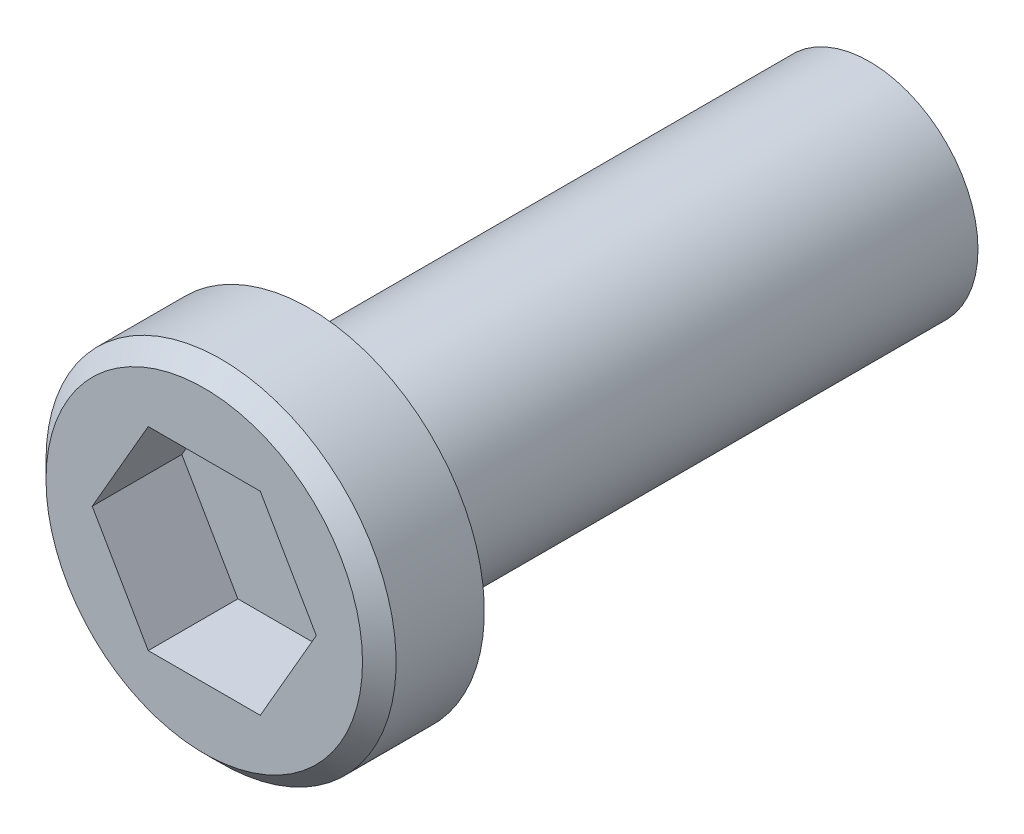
ISO-10303-21;
HEADER;
FILE_DESCRIPTION(('STEP AP214'),'2;1');
FILE_NAME('part.step','',(''),(''),'','','');
FILE_SCHEMA(('AUTOMOTIVE_DESIGN { 1 0 10303 214 1 1 1 1 }'));
ENDSEC;
DATA;
#1=APPLICATION_CONTEXT('core data for automotive mechanical design processes');
#2=APPLICATION_PROTOCOL_DEFINITION('international standard','automotive_design',2000,#1);
#3=PRODUCT_CONTEXT('',#1,'mechanical');
#4=PRODUCT('Part','Part','',(#3));
#5=PRODUCT_RELATED_PRODUCT_CATEGORY('part','',(#4));
#6=PRODUCT_DEFINITION_FORMATION('','',#4);
#7=PRODUCT_DEFINITION_CONTEXT('part definition',#1,'design');
#8=PRODUCT_DEFINITION('design','',#6,#7);
#9=PRODUCT_DEFINITION_SHAPE('','',#8);
#10=(LENGTH_UNIT() NAMED_UNIT(*) SI_UNIT(.MILLI.,.METRE.));
#11=(NAMED_UNIT(*) PLANE_ANGLE_UNIT() SI_UNIT($,.RADIAN.));
#12=(NAMED_UNIT(*) SI_UNIT($,.STERADIAN.) SOLID_ANGLE_UNIT());
#13=UNCERTAINTY_MEASURE_WITH_UNIT(LENGTH_MEASURE(1.E-05),#10,'distance_accuracy_value','');
#14=(GEOMETRIC_REPRESENTATION_CONTEXT(3) GLOBAL_UNCERTAINTY_ASSIGNED_CONTEXT((#13)) GLOBAL_UNIT_ASSIGNED_CONTEXT((#10,
#11,#12)) REPRESENTATION_CONTEXT('',''));
#15=CARTESIAN_POINT('',(0.,0.,0.));
#16=DIRECTION('',(0.,0.,1.));
#17=DIRECTION('',(1.,0.,0.));
#18=AXIS2_PLACEMENT_3D('',#15,#16,#17);
#19=CARTESIAN_POINT('',(0.,0.,25.4));
#20=DIRECTION('',(0.,0.,-1.));
#21=DIRECTION('',(-1.,0.,0.));
#22=AXIS2_PLACEMENT_3D('',#19,#20,#21);
#23=CYLINDRICAL_SURFACE('',#22,4.92125);
#24=CARTESIAN_POINT('',(0.,0.,25.4));
#25=DIRECTION('',(0.,0.,1.));
#26=DIRECTION('',(1.,0.,0.));
#27=AXIS2_PLACEMENT_3D('',#24,#25,#26);
#28=CIRCLE('',#27,4.92125);
#29=CARTESIAN_POINT('',(4.92125,0.,25.4));
#30=VERTEX_POINT('',#29);
#31=EDGE_CURVE('E143',#30,#30,#28,.T.);
#32=ORIENTED_EDGE('',*,*,#31,.F.);
#33=EDGE_LOOP('',(#32));
#34=FACE_BOUND('',#33,.T.);
#35=CARTESIAN_POINT('',(0.,0.,0.));
#36=DIRECTION('',(0.,0.,1.));
#37=DIRECTION('',(1.,0.,0.));
#38=AXIS2_PLACEMENT_3D('',#35,#36,#37);
#39=CIRCLE('',#38,4.92125);
#40=CARTESIAN_POINT('',(4.92125,0.,0.));
#41=VERTEX_POINT('',#40);
#42=EDGE_CURVE('E140',#41,#41,#39,.T.);
#43=ORIENTED_EDGE('',*,*,#42,.T.);
#44=EDGE_LOOP('',(#43));
#45=FACE_BOUND('',#44,.T.);
#46=ADVANCED_FACE('F29',(#34,#45),#23,.T.);
#47=CARTESIAN_POINT('',(0.,0.,0.));
#48=DIRECTION('',(0.,0.,1.));
#49=DIRECTION('',(1.,0.,0.));
#50=AXIS2_PLACEMENT_3D('',#47,#48,#49);
#51=PLANE('',#50);
#52=ORIENTED_EDGE('',*,*,#42,.F.);
#53=EDGE_LOOP('',(#52));
#54=FACE_BOUND('',#53,.T.);
#55=ADVANCED_FACE('F164',(#54),#51,.F.);
#56=CARTESIAN_POINT('',(0.,0.,25.4));
#57=DIRECTION('',(0.,0.,1.));
#58=DIRECTION('',(1.,0.,0.));
#59=AXIS2_PLACEMENT_3D('',#56,#57,#58);
#60=PLANE('',#59);
#61=CARTESIAN_POINT('',(0.,0.,25.4));
#62=DIRECTION('',(0.,0.,1.));
#63=DIRECTION('',(1.,0.,0.));
#64=AXIS2_PLACEMENT_3D('',#61,#62,#63);
#65=CIRCLE('',#64,7.9375);
#66=CARTESIAN_POINT('',(-7.9375,0.,25.4));
#67=VERTEX_POINT('',#66);
#68=EDGE_CURVE('E131',#67,#67,#65,.T.);
#69=ORIENTED_EDGE('',*,*,#68,.F.);
#70=EDGE_LOOP('',(#69));
#71=FACE_BOUND('',#70,.T.);
#72=ORIENTED_EDGE('',*,*,#31,.T.);
#73=EDGE_LOOP('',(#72));
#74=FACE_BOUND('',#73,.T.);
#75=ADVANCED_FACE('F169',(#71,#74),#60,.F.);
#76=CARTESIAN_POINT('',(0.,0.,30.1625));
#77=DIRECTION('',(0.,0.,-1.));
#78=DIRECTION('',(-1.,0.,0.));
#79=AXIS2_PLACEMENT_3D('',#76,#77,#78);
#80=CYLINDRICAL_SURFACE('',#79,7.9375);
#81=CARTESIAN_POINT('',(0.,0.,29.4005));
#82=DIRECTION('',(0.,0.,1.));
#83=DIRECTION('',(1.,0.,0.));
#84=AXIS2_PLACEMENT_3D('',#81,#82,#83);
#85=CIRCLE('',#84,7.9375);
#86=CARTESIAN_POINT('',(-7.9375,0.,29.4005));
#87=VERTEX_POINT('',#86);
#88=EDGE_CURVE('E11',#87,#87,#85,.F.);
#89=CARTESIAN_POINT('',(-7.9375,0.,29.4005));
#90=CARTESIAN_POINT('',(-7.9375,0.,29.358828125));
#91=CARTESIAN_POINT('',(-7.9375,0.,29.31715625));
#92=CARTESIAN_POINT('',(-7.9375,0.,29.2338125));
#93=CARTESIAN_POINT('',(-7.9375,0.,29.192140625));
#94=CARTESIAN_POINT('',(-7.9375,0.,29.108796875));
#95=CARTESIAN_POINT('',(-7.9375,0.,29.067125));
#96=CARTESIAN_POINT('',(-7.9375,0.,28.98378125));
#97=CARTESIAN_POINT('',(-7.9375,0.,28.942109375));
#98=CARTESIAN_POINT('',(-7.9375,0.,28.858765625));
#99=CARTESIAN_POINT('',(-7.9375,0.,28.81709375));
#100=CARTESIAN_POINT('',(-7.9375,0.,28.73375));
#101=CARTESIAN_POINT('',(-7.9375,0.,28.692078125));
#102=CARTESIAN_POINT('',(-7.9375,0.,28.608734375));
#103=CARTESIAN_POINT('',(-7.9375,0.,28.5670625));
#104=CARTESIAN_POINT('',(-7.9375,0.,28.48371875));
#105=CARTESIAN_POINT('',(-7.9375,0.,28.442046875));
#106=CARTESIAN_POINT('',(-7.9375,0.,28.358703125));
#107=CARTESIAN_POINT('',(-7.9375,0.,28.31703125));
#108=CARTESIAN_POINT('',(-7.9375,0.,28.2336875));
#109=CARTESIAN_POINT('',(-7.9375,0.,28.192015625));
#110=CARTESIAN_POINT('',(-7.9375,0.,28.108671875));
#111=CARTESIAN_POINT('',(-7.9375,0.,28.067));
#112=CARTESIAN_POINT('',(-7.9375,0.,27.98365625));
#113=CARTESIAN_POINT('',(-7.9375,0.,27.941984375));
#114=CARTESIAN_POINT('',(-7.9375,0.,27.858640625));
#115=CARTESIAN_POINT('',(-7.9375,0.,27.81696875));
#116=CARTESIAN_POINT('',(-7.9375,0.,27.733625));
#117=CARTESIAN_POINT('',(-7.9375,0.,27.691953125));
#118=CARTESIAN_POINT('',(-7.9375,0.,27.608609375));
#119=CARTESIAN_POINT('',(-7.9375,0.,27.5669375));
#120=CARTESIAN_POINT('',(-7.9375,0.,27.48359375));
#121=CARTESIAN_POINT('',(-7.9375,0.,27.441921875));
#122=CARTESIAN_POINT('',(-7.9375,0.,27.358578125));
#123=CARTESIAN_POINT('',(-7.9375,0.,27.31690625));
#124=CARTESIAN_POINT('',(-7.9375,0.,27.2335625));
#125=CARTESIAN_POINT('',(-7.9375,0.,27.191890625));
#126=CARTESIAN_POINT('',(-7.9375,0.,27.108546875));
#127=CARTESIAN_POINT('',(-7.9375,0.,27.066875));
#128=CARTESIAN_POINT('',(-7.9375,0.,26.98353125));
#129=CARTESIAN_POINT('',(-7.9375,0.,26.941859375));
#130=CARTESIAN_POINT('',(-7.9375,0.,26.858515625));
#131=CARTESIAN_POINT('',(-7.9375,0.,26.81684375));
#132=CARTESIAN_POINT('',(-7.9375,0.,26.7335));
#133=CARTESIAN_POINT('',(-7.9375,0.,26.691828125));
#134=CARTESIAN_POINT('',(-7.9375,0.,26.608484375));
#135=CARTESIAN_POINT('',(-7.9375,0.,26.5668125));
#136=CARTESIAN_POINT('',(-7.9375,0.,26.48346875));
#137=CARTESIAN_POINT('',(-7.9375,0.,26.441796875));
#138=CARTESIAN_POINT('',(-7.9375,0.,26.358453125));
#139=CARTESIAN_POINT('',(-7.9375,0.,26.31678125));
#140=CARTESIAN_POINT('',(-7.9375,0.,26.2334375));
#141=CARTESIAN_POINT('',(-7.9375,0.,26.191765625));
#142=CARTESIAN_POINT('',(-7.9375,0.,26.108421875));
#143=CARTESIAN_POINT('',(-7.9375,0.,26.06675));
#144=CARTESIAN_POINT('',(-7.9375,0.,25.98340625));
#145=CARTESIAN_POINT('',(-7.9375,0.,25.941734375));
#146=CARTESIAN_POINT('',(-7.9375,0.,25.858390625));
#147=CARTESIAN_POINT('',(-7.9375,0.,25.81671875));
#148=CARTESIAN_POINT('',(-7.9375,0.,25.733375));
#149=CARTESIAN_POINT('',(-7.9375,0.,25.691703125));
#150=CARTESIAN_POINT('',(-7.9375,0.,25.608359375));
#151=CARTESIAN_POINT('',(-7.9375,0.,25.5666875));
#152=CARTESIAN_POINT('',(-7.9375,0.,25.48334375));
#153=CARTESIAN_POINT('',(-7.9375,0.,25.441671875));
#154=CARTESIAN_POINT('',(-7.9375,0.,25.4));
#155=B_SPLINE_CURVE_WITH_KNOTS('',3,(#89,#90,#91,#92,#93,#94,#95,#96,#97,#98,#99,#100,#101,#102,
#103,#104,#105,#106,#107,#108,#109,#110,#111,#112,#113,#114,#115,#116,#117,#118,#119,#120,#121,
#122,#123,#124,#125,#126,#127,#128,#129,#130,#131,#132,#133,#134,#135,#136,#137,#138,#139,#140,
#141,#142,#143,#144,#145,#146,#147,#148,#149,#150,#151,#152,#153,#154),.UNSPECIFIED.,.F.,.F.,(4,
2,2,2,2,2,2,2,2,2,2,2,2,2,2,2,2,2,2,2,2,2,2,2,2,2,2,2,2,2,2,2,4),(0.,0.125015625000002,
0.250031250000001,0.375046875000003,0.500062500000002,0.625078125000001,0.750093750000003,
0.875109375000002,1.000125,1.125140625,1.25015625,1.375171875,1.5001875,1.625203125,1.75021875,
1.875234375,2.00025,2.125265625,2.25028125,2.375296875,2.5003125,2.625328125,2.75034375,
2.875359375,3.000375,3.125390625,3.25040625,3.375421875,3.5004375,3.625453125,3.75046875,
3.875484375,4.0005),.UNSPECIFIED.);
#156=EDGE_CURVE('BSEAM159',#87,#67,#155,.T.);
#157=ORIENTED_EDGE('',*,*,#88,.T.);
#158=ORIENTED_EDGE('',*,*,#68,.T.);
#159=ORIENTED_EDGE('',*,*,#156,.T.);
#160=ORIENTED_EDGE('',*,*,#156,.F.);
#161=EDGE_LOOP('',(#157,#159,#158,#160));
#162=FACE_BOUND('',#161,.T.);
#163=ADVANCED_FACE('F159',(#162),#80,.T.);
#164=CARTESIAN_POINT('',(0.,0.,30.1625));
#165=DIRECTION('',(0.,0.,1.));
#166=DIRECTION('',(1.,0.,0.));
#167=AXIS2_PLACEMENT_3D('',#164,#165,#166);
#168=PLANE('',#167);
#169=DIRECTION('',(0.5,0.866025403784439,0.));
#170=VECTOR('',#169,1.);
#171=CARTESIAN_POINT('',(2.54,-4.39940905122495,30.1625));
#172=LINE('',#171,#170);
#173=CARTESIAN_POINT('',(2.54,-4.39940905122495,30.1625));
#174=VERTEX_POINT('',#173);
#175=CARTESIAN_POINT('',(5.08,0.,30.1625));
#176=VERTEX_POINT('',#175);
#177=EDGE_CURVE('E43',#174,#176,#172,.T.);
#178=ORIENTED_EDGE('',*,*,#177,.F.);
#179=DIRECTION('',(1.,0.,0.));
#180=VECTOR('',#179,1.);
#181=CARTESIAN_POINT('',(-2.54,-4.39940905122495,30.1625));
#182=LINE('',#181,#180);
#183=CARTESIAN_POINT('',(-2.54,-4.39940905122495,30.1625));
#184=VERTEX_POINT('',#183);
#185=EDGE_CURVE('E113',#184,#174,#182,.T.);
#186=ORIENTED_EDGE('',*,*,#185,.F.);
#187=DIRECTION('',(0.5,-0.866025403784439,0.));
#188=VECTOR('',#187,1.);
#189=CARTESIAN_POINT('',(-5.08,0.,30.1625));
#190=LINE('',#189,#188);
#191=CARTESIAN_POINT('',(-5.08,0.,30.1625));
#192=VERTEX_POINT('',#191);
#193=EDGE_CURVE('E107',#192,#184,#190,.T.);
#194=ORIENTED_EDGE('',*,*,#193,.F.);
#195=DIRECTION('',(-0.5,-0.866025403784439,0.));
#196=VECTOR('',#195,1.);
#197=CARTESIAN_POINT('',(-2.54,4.39940905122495,30.1625));
#198=LINE('',#197,#196);
#199=CARTESIAN_POINT('',(-2.54,4.39940905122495,30.1625));
#200=VERTEX_POINT('',#199);
#201=EDGE_CURVE('E105',#200,#192,#198,.T.);
#202=ORIENTED_EDGE('',*,*,#201,.F.);
#203=DIRECTION('',(-1.,0.,0.));
#204=VECTOR('',#203,1.);
#205=CARTESIAN_POINT('',(2.54,4.39940905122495,30.1625));
#206=LINE('',#205,#204);
#207=CARTESIAN_POINT('',(2.54,4.39940905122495,30.1625));
#208=VERTEX_POINT('',#207);
#209=EDGE_CURVE('E86',#208,#200,#206,.T.);
#210=ORIENTED_EDGE('',*,*,#209,.F.);
#211=DIRECTION('',(-0.5,0.866025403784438,0.));
#212=VECTOR('',#211,1.);
#213=CARTESIAN_POINT('',(5.08,0.,30.1625));
#214=LINE('',#213,#212);
#215=EDGE_CURVE('E97',#176,#208,#214,.T.);
#216=ORIENTED_EDGE('',*,*,#215,.F.);
#217=EDGE_LOOP('',(#178,#186,#194,#202,#210,#216));
#218=FACE_BOUND('',#217,.T.);
#219=CARTESIAN_POINT('',(0.,0.,30.1625));
#220=DIRECTION('',(0.,0.,1.));
#221=DIRECTION('',(1.,0.,0.));
#222=AXIS2_PLACEMENT_3D('',#219,#220,#221);
#223=CIRCLE('',#222,7.1755);
#224=CARTESIAN_POINT('',(7.1755,0.,30.1625));
#225=VERTEX_POINT('',#224);
#226=EDGE_CURVE('E36',#225,#225,#223,.T.);
#227=ORIENTED_EDGE('',*,*,#226,.T.);
#228=EDGE_LOOP('',(#227));
#229=FACE_BOUND('',#228,.T.);
#230=ADVANCED_FACE('F101',(#218,#229),#168,.T.);
#231=CARTESIAN_POINT('',(0.,0.,30.1625));
#232=DIRECTION('',(0.,0.,-1.));
#233=DIRECTION('',(-1.,0.,0.));
#234=AXIS2_PLACEMENT_3D('',#231,#232,#233);
#235=CONICAL_SURFACE('',#234,7.1755,0.785398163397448);
#236=ORIENTED_EDGE('',*,*,#88,.F.);
#237=EDGE_LOOP('',(#236));
#238=FACE_BOUND('',#237,.T.);
#239=ORIENTED_EDGE('',*,*,#226,.F.);
#240=EDGE_LOOP('',(#239));
#241=FACE_BOUND('',#240,.T.);
#242=ADVANCED_FACE('F148',(#238,#241),#235,.T.);
#243=CARTESIAN_POINT('',(2.54,-4.39940905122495,26.0985));
#244=DIRECTION('',(0.866025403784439,-0.5,0.));
#245=DIRECTION('',(0.5,0.866025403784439,0.));
#246=AXIS2_PLACEMENT_3D('',#243,#244,#245);
#247=PLANE('',#246);
#248=ORIENTED_EDGE('',*,*,#177,.T.);
#249=DIRECTION('',(0.,0.,1.));
#250=VECTOR('',#249,1.);
#251=CARTESIAN_POINT('',(5.08,0.,26.0985));
#252=LINE('',#251,#250);
#253=CARTESIAN_POINT('',(5.08,0.,26.0985));
#254=VERTEX_POINT('',#253);
#255=EDGE_CURVE('E94',#254,#176,#252,.T.);
#256=ORIENTED_EDGE('',*,*,#255,.F.);
#257=DIRECTION('',(0.5,0.866025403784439,0.));
#258=VECTOR('',#257,1.);
#259=CARTESIAN_POINT('',(2.54,-4.39940905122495,26.0985));
#260=LINE('',#259,#258);
#261=CARTESIAN_POINT('',(2.54,-4.39940905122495,26.0985));
#262=VERTEX_POINT('',#261);
#263=EDGE_CURVE('E115',#262,#254,#260,.T.);
#264=ORIENTED_EDGE('',*,*,#263,.F.);
#265=DIRECTION('',(0.,0.,1.));
#266=VECTOR('',#265,1.);
#267=CARTESIAN_POINT('',(2.54,-4.39940905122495,26.0985));
#268=LINE('',#267,#266);
#269=EDGE_CURVE('E50',#262,#174,#268,.T.);
#270=ORIENTED_EDGE('',*,*,#269,.T.);
#271=EDGE_LOOP('',(#248,#256,#264,#270));
#272=FACE_BOUND('',#271,.T.);
#273=ADVANCED_FACE('F150',(#272),#247,.F.);
#274=CARTESIAN_POINT('',(-2.54,-4.39940905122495,26.0985));
#275=DIRECTION('',(0.,-1.,0.));
#276=DIRECTION('',(0.,0.,-1.));
#277=AXIS2_PLACEMENT_3D('',#274,#275,#276);
#278=PLANE('',#277);
#279=ORIENTED_EDGE('',*,*,#185,.T.);
#280=ORIENTED_EDGE('',*,*,#269,.F.);
#281=DIRECTION('',(1.,0.,0.));
#282=VECTOR('',#281,1.);
#283=CARTESIAN_POINT('',(-2.54,-4.39940905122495,26.0985));
#284=LINE('',#283,#282);
#285=CARTESIAN_POINT('',(-2.54,-4.39940905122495,26.0985));
#286=VERTEX_POINT('',#285);
#287=EDGE_CURVE('E127',#286,#262,#284,.T.);
#288=ORIENTED_EDGE('',*,*,#287,.F.);
#289=DIRECTION('',(0.,0.,1.));
#290=VECTOR('',#289,1.);
#291=CARTESIAN_POINT('',(-2.54,-4.39940905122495,26.0985));
#292=LINE('',#291,#290);
#293=EDGE_CURVE('E132',#286,#184,#292,.T.);
#294=ORIENTED_EDGE('',*,*,#293,.T.);
#295=EDGE_LOOP('',(#279,#280,#288,#294));
#296=FACE_BOUND('',#295,.T.);
#297=ADVANCED_FACE('F157',(#296),#278,.F.);
#298=CARTESIAN_POINT('',(-5.08,0.,26.0985));
#299=DIRECTION('',(-0.866025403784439,-0.5,0.));
#300=DIRECTION('',(0.5,-0.866025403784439,0.));
#301=AXIS2_PLACEMENT_3D('',#298,#299,#300);
#302=PLANE('',#301);
#303=ORIENTED_EDGE('',*,*,#193,.T.);
#304=ORIENTED_EDGE('',*,*,#293,.F.);
#305=DIRECTION('',(0.5,-0.866025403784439,0.));
#306=VECTOR('',#305,1.);
#307=CARTESIAN_POINT('',(-5.08,0.,26.0985));
#308=LINE('',#307,#306);
#309=CARTESIAN_POINT('',(-5.08,0.,26.0985));
#310=VERTEX_POINT('',#309);
#311=EDGE_CURVE('E124',#310,#286,#308,.T.);
#312=ORIENTED_EDGE('',*,*,#311,.F.);
#313=DIRECTION('',(0.,0.,1.));
#314=VECTOR('',#313,1.);
#315=CARTESIAN_POINT('',(-5.08,0.,26.0985));
#316=LINE('',#315,#314);
#317=EDGE_CURVE('E134',#310,#192,#316,.T.);
#318=ORIENTED_EDGE('',*,*,#317,.T.);
#319=EDGE_LOOP('',(#303,#304,#312,#318));
#320=FACE_BOUND('',#319,.T.);
#321=ADVANCED_FACE('F207',(#320),#302,.F.);
#322=CARTESIAN_POINT('',(-2.54,4.39940905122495,26.0985));
#323=DIRECTION('',(-0.866025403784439,0.5,0.));
#324=DIRECTION('',(-0.5,-0.866025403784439,0.));
#325=AXIS2_PLACEMENT_3D('',#322,#323,#324);
#326=PLANE('',#325);
#327=ORIENTED_EDGE('',*,*,#201,.T.);
#328=ORIENTED_EDGE('',*,*,#317,.F.);
#329=DIRECTION('',(-0.5,-0.866025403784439,0.));
#330=VECTOR('',#329,1.);
#331=CARTESIAN_POINT('',(-2.54,4.39940905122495,26.0985));
#332=LINE('',#331,#330);
#333=CARTESIAN_POINT('',(-2.54,4.39940905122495,26.0985));
#334=VERTEX_POINT('',#333);
#335=EDGE_CURVE('E121',#334,#310,#332,.T.);
#336=ORIENTED_EDGE('',*,*,#335,.F.);
#337=DIRECTION('',(0.,0.,1.));
#338=VECTOR('',#337,1.);
#339=CARTESIAN_POINT('',(-2.54,4.39940905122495,26.0985));
#340=LINE('',#339,#338);
#341=EDGE_CURVE('E93',#334,#200,#340,.T.);
#342=ORIENTED_EDGE('',*,*,#341,.T.);
#343=EDGE_LOOP('',(#327,#328,#336,#342));
#344=FACE_BOUND('',#343,.T.);
#345=ADVANCED_FACE('F216',(#344),#326,.F.);
#346=CARTESIAN_POINT('',(2.54,4.39940905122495,26.0985));
#347=DIRECTION('',(0.,1.,0.));
#348=DIRECTION('',(-1.,0.,0.));
#349=AXIS2_PLACEMENT_3D('',#346,#347,#348);
#350=PLANE('',#349);
#351=ORIENTED_EDGE('',*,*,#209,.T.);
#352=ORIENTED_EDGE('',*,*,#341,.F.);
#353=DIRECTION('',(-1.,0.,0.));
#354=VECTOR('',#353,1.);
#355=CARTESIAN_POINT('',(2.54,4.39940905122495,26.0985));
#356=LINE('',#355,#354);
#357=CARTESIAN_POINT('',(2.54,4.39940905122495,26.0985));
#358=VERTEX_POINT('',#357);
#359=EDGE_CURVE('E89',#358,#334,#356,.T.);
#360=ORIENTED_EDGE('',*,*,#359,.F.);
#361=DIRECTION('',(0.,0.,1.));
#362=VECTOR('',#361,1.);
#363=CARTESIAN_POINT('',(2.54,4.39940905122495,26.0985));
#364=LINE('',#363,#362);
#365=EDGE_CURVE('E82',#358,#208,#364,.T.);
#366=ORIENTED_EDGE('',*,*,#365,.T.);
#367=EDGE_LOOP('',(#351,#352,#360,#366));
#368=FACE_BOUND('',#367,.T.);
#369=ADVANCED_FACE('F84',(#368),#350,.F.);
#370=CARTESIAN_POINT('',(5.08,0.,26.0985));
#371=DIRECTION('',(0.866025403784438,0.5,0.));
#372=DIRECTION('',(-0.5,0.866025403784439,0.));
#373=AXIS2_PLACEMENT_3D('',#370,#371,#372);
#374=PLANE('',#373);
#375=ORIENTED_EDGE('',*,*,#215,.T.);
#376=ORIENTED_EDGE('',*,*,#365,.F.);
#377=DIRECTION('',(-0.5,0.866025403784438,0.));
#378=VECTOR('',#377,1.);
#379=CARTESIAN_POINT('',(5.08,0.,26.0985));
#380=LINE('',#379,#378);
#381=EDGE_CURVE('E118',#254,#358,#380,.T.);
#382=ORIENTED_EDGE('',*,*,#381,.F.);
#383=ORIENTED_EDGE('',*,*,#255,.T.);
#384=EDGE_LOOP('',(#375,#376,#382,#383));
#385=FACE_BOUND('',#384,.T.);
#386=ADVANCED_FACE('F98',(#385),#374,.F.);
#387=CARTESIAN_POINT('',(7.62,4.39940905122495,26.0985));
#388=DIRECTION('',(0.,0.,1.));
#389=DIRECTION('',(1.,0.,0.));
#390=AXIS2_PLACEMENT_3D('',#387,#388,#389);
#391=PLANE('',#390);
#392=ORIENTED_EDGE('',*,*,#263,.T.);
#393=ORIENTED_EDGE('',*,*,#381,.T.);
#394=ORIENTED_EDGE('',*,*,#359,.T.);
#395=ORIENTED_EDGE('',*,*,#335,.T.);
#396=ORIENTED_EDGE('',*,*,#311,.T.);
#397=ORIENTED_EDGE('',*,*,#287,.T.);
#398=EDGE_LOOP('',(#392,#393,#394,#395,#396,#397));
#399=FACE_BOUND('',#398,.T.);
#400=ADVANCED_FACE('F243',(#399),#391,.T.);
#401=CLOSED_SHELL('',(#46,#55,#75,#163,#230,#242,#273,#297,#321,#345,#369,#386,#400));
#402=MANIFOLD_SOLID_BREP('B2',#401);
#403=ADVANCED_BREP_SHAPE_REPRESENTATION('',(#18,#402),#14);
#404=SHAPE_DEFINITION_REPRESENTATION(#9,#403);
ENDSEC;
END-ISO-10303-21;
